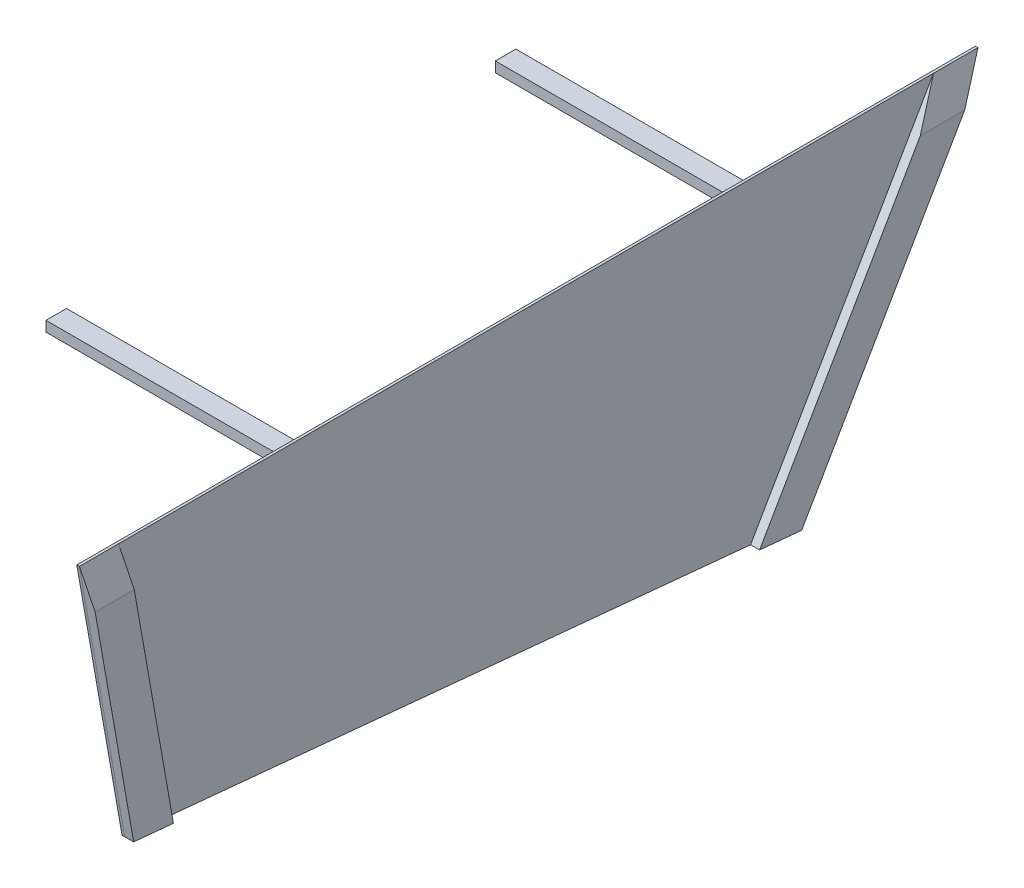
ISO-10303-21;
HEADER;
FILE_DESCRIPTION(('STEP AP214'),'2;1');
FILE_NAME('part.step','',(''),(''),'','','');
FILE_SCHEMA(('AUTOMOTIVE_DESIGN { 1 0 10303 214 1 1 1 1 }'));
ENDSEC;
DATA;
#1=APPLICATION_CONTEXT('core data for automotive mechanical design processes');
#2=APPLICATION_PROTOCOL_DEFINITION('international standard','automotive_design',2000,#1);
#3=PRODUCT_CONTEXT('',#1,'mechanical');
#4=PRODUCT('Part','Part','',(#3));
#5=PRODUCT_RELATED_PRODUCT_CATEGORY('part','',(#4));
#6=PRODUCT_DEFINITION_FORMATION('','',#4);
#7=PRODUCT_DEFINITION_CONTEXT('part definition',#1,'design');
#8=PRODUCT_DEFINITION('design','',#6,#7);
#9=PRODUCT_DEFINITION_SHAPE('','',#8);
#10=(LENGTH_UNIT() NAMED_UNIT(*) SI_UNIT(.MILLI.,.METRE.));
#11=(NAMED_UNIT(*) PLANE_ANGLE_UNIT() SI_UNIT($,.RADIAN.));
#12=(NAMED_UNIT(*) SI_UNIT($,.STERADIAN.) SOLID_ANGLE_UNIT());
#13=UNCERTAINTY_MEASURE_WITH_UNIT(LENGTH_MEASURE(1.E-05),#10,'distance_accuracy_value','');
#14=(GEOMETRIC_REPRESENTATION_CONTEXT(3) GLOBAL_UNCERTAINTY_ASSIGNED_CONTEXT((#13)) GLOBAL_UNIT_ASSIGNED_CONTEXT((#10,
#11,#12)) REPRESENTATION_CONTEXT('',''));
#15=CARTESIAN_POINT('',(0.,0.,0.));
#16=DIRECTION('',(0.,0.,1.));
#17=DIRECTION('',(1.,0.,0.));
#18=AXIS2_PLACEMENT_3D('',#15,#16,#17);
#19=CARTESIAN_POINT('',(40.,-974.233000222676,-2508.54773161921));
#20=DIRECTION('',(0.,-0.5,-0.866025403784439));
#21=DIRECTION('',(0.,0.866025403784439,-0.5));
#22=AXIS2_PLACEMENT_3D('',#19,#20,#21);
#23=PLANE('',#22);
#24=DIRECTION('',(0.,-0.866025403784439,0.5));
#25=VECTOR('',#24,1.);
#26=CARTESIAN_POINT('',(40.,-974.233000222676,-2508.54773161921));
#27=LINE('',#26,#25);
#28=CARTESIAN_POINT('',(40.,110.000000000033,-3134.52994616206));
#29=VERTEX_POINT('',#28);
#30=CARTESIAN_POINT('',(40.,-974.233000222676,-2508.54773161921));
#31=VERTEX_POINT('',#30);
#32=EDGE_CURVE('E101',#29,#31,#27,.T.);
#33=ORIENTED_EDGE('',*,*,#32,.F.);
#34=DIRECTION('',(0.198069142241,-0.84886775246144,0.490094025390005));
#35=VECTOR('',#34,1.);
#36=CARTESIAN_POINT('',(344.276668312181,-1194.04286419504,-2381.64044748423));
#37=LINE('',#36,#35);
#38=CARTESIAN_POINT('',(5.,260.000000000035,-3221.13248654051));
#39=VERTEX_POINT('',#38);
#40=EDGE_CURVE('E62',#29,#39,#37,.F.);
#41=ORIENTED_EDGE('',*,*,#40,.T.);
#42=DIRECTION('',(0.,-0.866025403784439,0.5));
#43=VECTOR('',#42,1.);
#44=CARTESIAN_POINT('',(5.,-974.233000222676,-2508.54773161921));
#45=LINE('',#44,#43);
#46=CARTESIAN_POINT('',(5.,-974.233000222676,-2508.54773161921));
#47=VERTEX_POINT('',#46);
#48=EDGE_CURVE('E106',#39,#47,#45,.T.);
#49=ORIENTED_EDGE('',*,*,#48,.T.);
#50=DIRECTION('',(-1.,0.,0.));
#51=VECTOR('',#50,1.);
#52=CARTESIAN_POINT('',(40.,-974.233000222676,-2508.54773161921));
#53=LINE('',#52,#51);
#54=EDGE_CURVE('E121',#31,#47,#53,.T.);
#55=ORIENTED_EDGE('',*,*,#54,.F.);
#56=EDGE_LOOP('',(#33,#41,#49,#55));
#57=FACE_BOUND('',#56,.T.);
#58=ADVANCED_FACE('F53',(#57),#23,.F.);
#59=CARTESIAN_POINT('',(40.,-989.999999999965,-2672.64973081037));
#60=DIRECTION('',(0.,0.995415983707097,-0.0956400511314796));
#61=DIRECTION('',(0.,0.0956400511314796,0.995415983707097));
#62=AXIS2_PLACEMENT_3D('',#59,#60,#61);
#63=PLANE('',#62);
#64=DIRECTION('',(0.,-0.0956400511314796,-0.995415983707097));
#65=VECTOR('',#64,1.);
#66=CARTESIAN_POINT('',(5.,-989.999999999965,-2672.64973081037));
#67=LINE('',#66,#65);
#68=CARTESIAN_POINT('',(5.,-989.999999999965,-2672.64973081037));
#69=VERTEX_POINT('',#68);
#70=EDGE_CURVE('E100',#47,#69,#67,.T.);
#71=ORIENTED_EDGE('',*,*,#70,.T.);
#72=DIRECTION('',(-1.,0.,0.));
#73=VECTOR('',#72,1.);
#74=CARTESIAN_POINT('',(40.,-989.999999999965,-2672.64973081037));
#75=LINE('',#74,#73);
#76=CARTESIAN_POINT('',(40.,-989.999999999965,-2672.64973081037));
#77=VERTEX_POINT('',#76);
#78=EDGE_CURVE('E97',#77,#69,#75,.T.);
#79=ORIENTED_EDGE('',*,*,#78,.F.);
#80=DIRECTION('',(0.,-0.0956400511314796,-0.995415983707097));
#81=VECTOR('',#80,1.);
#82=CARTESIAN_POINT('',(40.,-989.999999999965,-2672.64973081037));
#83=LINE('',#82,#81);
#84=EDGE_CURVE('E114',#31,#77,#83,.T.);
#85=ORIENTED_EDGE('',*,*,#84,.F.);
#86=ORIENTED_EDGE('',*,*,#54,.T.);
#87=EDGE_LOOP('',(#71,#79,#85,#86));
#88=FACE_BOUND('',#87,.T.);
#89=ADVANCED_FACE('F126',(#88),#63,.F.);
#90=CARTESIAN_POINT('',(40.,260.000000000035,-3394.33756729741));
#91=DIRECTION('',(0.,0.500000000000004,0.866025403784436));
#92=DIRECTION('',(0.,-0.866025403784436,0.500000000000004));
#93=AXIS2_PLACEMENT_3D('',#90,#91,#92);
#94=PLANE('',#93);
#95=DIRECTION('',(0.,0.866025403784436,-0.500000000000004));
#96=VECTOR('',#95,1.);
#97=CARTESIAN_POINT('',(5.,260.000000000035,-3394.33756729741));
#98=LINE('',#97,#96);
#99=CARTESIAN_POINT('',(5.,260.000000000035,-3394.33756729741));
#100=VERTEX_POINT('',#99);
#101=EDGE_CURVE('E93',#69,#100,#98,.T.);
#102=ORIENTED_EDGE('',*,*,#101,.T.);
#103=DIRECTION('',(-0.198069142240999,0.848867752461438,-0.490094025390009));
#104=VECTOR('',#103,1.);
#105=CARTESIAN_POINT('',(361.090119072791,-1266.10051031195,-2513.24302685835));
#106=LINE('',#105,#104);
#107=CARTESIAN_POINT('',(40.,110.000000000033,-3307.73502691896));
#108=VERTEX_POINT('',#107);
#109=EDGE_CURVE('E12',#100,#108,#106,.F.);
#110=ORIENTED_EDGE('',*,*,#109,.T.);
#111=DIRECTION('',(0.,0.866025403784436,-0.500000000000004));
#112=VECTOR('',#111,1.);
#113=CARTESIAN_POINT('',(40.,260.000000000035,-3394.33756729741));
#114=LINE('',#113,#112);
#115=EDGE_CURVE('E116',#77,#108,#114,.T.);
#116=ORIENTED_EDGE('',*,*,#115,.F.);
#117=ORIENTED_EDGE('',*,*,#78,.T.);
#118=EDGE_LOOP('',(#102,#110,#116,#117));
#119=FACE_BOUND('',#118,.T.);
#120=ADVANCED_FACE('F95',(#119),#94,.F.);
#121=CARTESIAN_POINT('',(40.,0.,0.));
#122=DIRECTION('',(-1.,0.,0.));
#123=DIRECTION('',(0.,0.,1.));
#124=AXIS2_PLACEMENT_3D('',#121,#122,#123);
#125=PLANE('',#124);
#126=ORIENTED_EDGE('',*,*,#115,.T.);
#127=DIRECTION('',(0.,0.,1.));
#128=VECTOR('',#127,1.);
#129=CARTESIAN_POINT('',(40.,110.000000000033,0.));
#130=LINE('',#129,#128);
#131=EDGE_CURVE('E107',#108,#29,#130,.T.);
#132=ORIENTED_EDGE('',*,*,#131,.T.);
#133=ORIENTED_EDGE('',*,*,#32,.T.);
#134=ORIENTED_EDGE('',*,*,#84,.T.);
#135=EDGE_LOOP('',(#126,#132,#133,#134));
#136=FACE_BOUND('',#135,.T.);
#137=ADVANCED_FACE('F128',(#136),#125,.F.);
#138=CARTESIAN_POINT('',(5.,0.,0.));
#139=DIRECTION('',(-1.,0.,0.));
#140=DIRECTION('',(0.,0.,1.));
#141=AXIS2_PLACEMENT_3D('',#138,#139,#140);
#142=PLANE('',#141);
#143=DIRECTION('',(0.,0.,1.));
#144=VECTOR('',#143,1.);
#145=CARTESIAN_POINT('',(5.,260.000000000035,-3221.13248654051));
#146=LINE('',#145,#144);
#147=EDGE_CURVE('E104',#100,#39,#146,.T.);
#148=ORIENTED_EDGE('',*,*,#147,.F.);
#149=ORIENTED_EDGE('',*,*,#101,.F.);
#150=ORIENTED_EDGE('',*,*,#70,.F.);
#151=ORIENTED_EDGE('',*,*,#48,.F.);
#152=EDGE_LOOP('',(#148,#149,#150,#151));
#153=FACE_BOUND('',#152,.T.);
#154=ADVANCED_FACE('F105',(#153),#142,.T.);
#155=CARTESIAN_POINT('',(40.,110.000000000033,0.));
#156=DIRECTION('',(-0.973841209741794,-0.227229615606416,0.));
#157=DIRECTION('',(0.,0.,1.));
#158=AXIS2_PLACEMENT_3D('',#155,#156,#157);
#159=PLANE('',#158);
#160=ORIENTED_EDGE('',*,*,#109,.F.);
#161=ORIENTED_EDGE('',*,*,#147,.T.);
#162=ORIENTED_EDGE('',*,*,#40,.F.);
#163=ORIENTED_EDGE('',*,*,#131,.F.);
#164=EDGE_LOOP('',(#160,#161,#162,#163));
#165=FACE_BOUND('',#164,.T.);
#166=ADVANCED_FACE('F56',(#165),#159,.F.);
#167=CLOSED_SHELL('',(#58,#89,#120,#137,#154,#166));
#168=MANIFOLD_SOLID_BREP('B2',#167);
#169=CARTESIAN_POINT('',(40.,260.000000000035,105.662432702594));
#170=DIRECTION('',(0.,0.173648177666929,-0.984807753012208));
#171=DIRECTION('',(0.,0.984807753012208,0.173648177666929));
#172=AXIS2_PLACEMENT_3D('',#169,#170,#171);
#173=PLANE('',#172);
#174=DIRECTION('',(0.,-0.984807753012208,-0.173648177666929));
#175=VECTOR('',#174,1.);
#176=CARTESIAN_POINT('',(40.,260.000000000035,105.662432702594));
#177=LINE('',#176,#175);
#178=CARTESIAN_POINT('',(40.,110.000000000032,79.2133855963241));
#179=VERTEX_POINT('',#178);
#180=CARTESIAN_POINT('',(40.,-739.999999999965,-70.6645480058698));
#181=VERTEX_POINT('',#180);
#182=EDGE_CURVE('E240',#179,#181,#177,.T.);
#183=ORIENTED_EDGE('',*,*,#182,.F.);
#184=DIRECTION('',(-0.223951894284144,0.959793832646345,0.169237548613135));
#185=VECTOR('',#184,1.);
#186=CARTESIAN_POINT('',(43.0022720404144,97.1331198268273,76.9446074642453));
#187=LINE('',#186,#185);
#188=CARTESIAN_POINT('',(5.,260.000000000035,105.662432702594));
#189=VERTEX_POINT('',#188);
#190=EDGE_CURVE('E209',#179,#189,#187,.T.);
#191=ORIENTED_EDGE('',*,*,#190,.T.);
#192=DIRECTION('',(0.,-0.984807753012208,-0.173648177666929));
#193=VECTOR('',#192,1.);
#194=CARTESIAN_POINT('',(5.,260.000000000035,105.662432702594));
#195=LINE('',#194,#193);
#196=CARTESIAN_POINT('',(5.,-739.999999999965,-70.6645480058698));
#197=VERTEX_POINT('',#196);
#198=EDGE_CURVE('E253',#189,#197,#195,.T.);
#199=ORIENTED_EDGE('',*,*,#198,.T.);
#200=DIRECTION('',(-1.,0.,0.));
#201=VECTOR('',#200,1.);
#202=CARTESIAN_POINT('',(40.,-739.999999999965,-70.6645480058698));
#203=LINE('',#202,#201);
#204=EDGE_CURVE('E251',#181,#197,#203,.T.);
#205=ORIENTED_EDGE('',*,*,#204,.F.);
#206=EDGE_LOOP('',(#183,#191,#199,#205));
#207=FACE_BOUND('',#206,.T.);
#208=ADVANCED_FACE('F200',(#207),#173,.F.);
#209=CARTESIAN_POINT('',(40.,-754.886604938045,-225.603449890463));
#210=DIRECTION('',(0.,0.995415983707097,-0.09564005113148));
#211=DIRECTION('',(0.,0.09564005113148,0.995415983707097));
#212=AXIS2_PLACEMENT_3D('',#209,#210,#211);
#213=PLANE('',#212);
#214=DIRECTION('',(0.,-0.09564005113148,-0.995415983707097));
#215=VECTOR('',#214,1.);
#216=CARTESIAN_POINT('',(5.,-754.886604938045,-225.603449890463));
#217=LINE('',#216,#215);
#218=CARTESIAN_POINT('',(5.,-754.886604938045,-225.603449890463));
#219=VERTEX_POINT('',#218);
#220=EDGE_CURVE('E267',#197,#219,#217,.T.);
#221=ORIENTED_EDGE('',*,*,#220,.T.);
#222=DIRECTION('',(-1.,0.,0.));
#223=VECTOR('',#222,1.);
#224=CARTESIAN_POINT('',(40.,-754.886604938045,-225.603449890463));
#225=LINE('',#224,#223);
#226=CARTESIAN_POINT('',(40.,-754.886604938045,-225.603449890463));
#227=VERTEX_POINT('',#226);
#228=EDGE_CURVE('E256',#227,#219,#225,.T.);
#229=ORIENTED_EDGE('',*,*,#228,.F.);
#230=DIRECTION('',(0.,-0.09564005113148,-0.995415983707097));
#231=VECTOR('',#230,1.);
#232=CARTESIAN_POINT('',(40.,-754.886604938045,-225.603449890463));
#233=LINE('',#232,#231);
#234=EDGE_CURVE('E244',#181,#227,#233,.T.);
#235=ORIENTED_EDGE('',*,*,#234,.F.);
#236=ORIENTED_EDGE('',*,*,#204,.T.);
#237=EDGE_LOOP('',(#221,#229,#235,#236));
#238=FACE_BOUND('',#237,.T.);
#239=ADVANCED_FACE('F258',(#238),#213,.F.);
#240=CARTESIAN_POINT('',(40.,260.000000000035,-46.6515590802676));
#241=DIRECTION('',(0.,-0.173648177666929,0.984807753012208));
#242=DIRECTION('',(0.,-0.984807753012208,-0.173648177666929));
#243=AXIS2_PLACEMENT_3D('',#240,#241,#242);
#244=PLANE('',#243);
#245=DIRECTION('',(0.,0.984807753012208,0.17364817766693));
#246=VECTOR('',#245,1.);
#247=CARTESIAN_POINT('',(5.,260.000000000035,-46.6515590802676));
#248=LINE('',#247,#246);
#249=CARTESIAN_POINT('',(5.,260.000000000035,-46.6515590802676));
#250=VERTEX_POINT('',#249);
#251=EDGE_CURVE('E248',#219,#250,#248,.T.);
#252=ORIENTED_EDGE('',*,*,#251,.T.);
#253=DIRECTION('',(0.223951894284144,-0.959793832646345,-0.169237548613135));
#254=VECTOR('',#253,1.);
#255=CARTESIAN_POINT('',(37.2294088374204,121.873962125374,-71.0069062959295));
#256=LINE('',#255,#254);
#257=CARTESIAN_POINT('',(40.,110.000000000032,-73.1006061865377));
#258=VERTEX_POINT('',#257);
#259=EDGE_CURVE('E51',#250,#258,#256,.T.);
#260=ORIENTED_EDGE('',*,*,#259,.T.);
#261=DIRECTION('',(0.,0.984807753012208,0.17364817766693));
#262=VECTOR('',#261,1.);
#263=CARTESIAN_POINT('',(40.,260.000000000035,-46.6515590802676));
#264=LINE('',#263,#262);
#265=EDGE_CURVE('E260',#227,#258,#264,.T.);
#266=ORIENTED_EDGE('',*,*,#265,.F.);
#267=ORIENTED_EDGE('',*,*,#228,.T.);
#268=EDGE_LOOP('',(#252,#260,#266,#267));
#269=FACE_BOUND('',#268,.T.);
#270=ADVANCED_FACE('F284',(#269),#244,.F.);
#271=CARTESIAN_POINT('',(40.,0.,0.));
#272=DIRECTION('',(1.,0.,0.));
#273=DIRECTION('',(0.,0.,-1.));
#274=AXIS2_PLACEMENT_3D('',#271,#272,#273);
#275=PLANE('',#274);
#276=ORIENTED_EDGE('',*,*,#265,.T.);
#277=DIRECTION('',(0.,0.,1.));
#278=VECTOR('',#277,1.);
#279=CARTESIAN_POINT('',(40.,110.000000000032,105.662432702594));
#280=LINE('',#279,#278);
#281=EDGE_CURVE('E246',#258,#179,#280,.T.);
#282=ORIENTED_EDGE('',*,*,#281,.T.);
#283=ORIENTED_EDGE('',*,*,#182,.T.);
#284=ORIENTED_EDGE('',*,*,#234,.T.);
#285=EDGE_LOOP('',(#276,#282,#283,#284));
#286=FACE_BOUND('',#285,.T.);
#287=ADVANCED_FACE('F242',(#286),#275,.T.);
#288=CARTESIAN_POINT('',(5.,0.,0.));
#289=DIRECTION('',(1.,0.,0.));
#290=DIRECTION('',(0.,0.,-1.));
#291=AXIS2_PLACEMENT_3D('',#288,#289,#290);
#292=PLANE('',#291);
#293=DIRECTION('',(0.,0.,1.));
#294=VECTOR('',#293,1.);
#295=CARTESIAN_POINT('',(5.,260.000000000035,-46.6515590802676));
#296=LINE('',#295,#294);
#297=EDGE_CURVE('E264',#250,#189,#296,.T.);
#298=ORIENTED_EDGE('',*,*,#297,.F.);
#299=ORIENTED_EDGE('',*,*,#251,.F.);
#300=ORIENTED_EDGE('',*,*,#220,.F.);
#301=ORIENTED_EDGE('',*,*,#198,.F.);
#302=EDGE_LOOP('',(#298,#299,#300,#301));
#303=FACE_BOUND('',#302,.T.);
#304=ADVANCED_FACE('F273',(#303),#292,.F.);
#305=CARTESIAN_POINT('',(40.,110.000000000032,0.));
#306=DIRECTION('',(0.973841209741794,0.227229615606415,0.));
#307=DIRECTION('',(0.,0.,-1.));
#308=AXIS2_PLACEMENT_3D('',#305,#306,#307);
#309=PLANE('',#308);
#310=ORIENTED_EDGE('',*,*,#259,.F.);
#311=ORIENTED_EDGE('',*,*,#297,.T.);
#312=ORIENTED_EDGE('',*,*,#190,.F.);
#313=ORIENTED_EDGE('',*,*,#281,.F.);
#314=EDGE_LOOP('',(#310,#311,#312,#313));
#315=FACE_BOUND('',#314,.T.);
#316=ADVANCED_FACE('F203',(#315),#309,.T.);
#317=CLOSED_SHELL('',(#208,#239,#270,#287,#304,#316));
#318=MANIFOLD_SOLID_BREP('B6',#317);
#319=CARTESIAN_POINT('',(5.,260.000000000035,-3394.33756729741));
#320=DIRECTION('',(0.,0.500000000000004,0.866025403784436));
#321=DIRECTION('',(0.,-0.866025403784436,0.500000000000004));
#322=AXIS2_PLACEMENT_3D('',#319,#320,#321);
#323=PLANE('',#322);
#324=DIRECTION('',(0.,0.866025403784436,-0.500000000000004));
#325=VECTOR('',#324,1.);
#326=CARTESIAN_POINT('',(-5.,260.000000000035,-3394.33756729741));
#327=LINE('',#326,#325);
#328=CARTESIAN_POINT('',(-5.,-989.999999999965,-2672.64973081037));
#329=VERTEX_POINT('',#328);
#330=CARTESIAN_POINT('',(-5.,260.000000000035,-3394.33756729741));
#331=VERTEX_POINT('',#330);
#332=EDGE_CURVE('E468',#329,#331,#327,.T.);
#333=ORIENTED_EDGE('',*,*,#332,.T.);
#334=DIRECTION('',(-1.,0.,0.));
#335=VECTOR('',#334,1.);
#336=CARTESIAN_POINT('',(5.,260.000000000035,-3394.33756729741));
#337=LINE('',#336,#335);
#338=CARTESIAN_POINT('',(5.,260.000000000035,-3394.33756729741));
#339=VERTEX_POINT('',#338);
#340=EDGE_CURVE('E502',#339,#331,#337,.T.);
#341=ORIENTED_EDGE('',*,*,#340,.F.);
#342=DIRECTION('',(0.,0.866025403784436,-0.500000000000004));
#343=VECTOR('',#342,1.);
#344=CARTESIAN_POINT('',(5.,-989.999999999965,-2672.64973081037));
#345=LINE('',#344,#343);
#346=CARTESIAN_POINT('',(5.,-989.999999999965,-2672.64973081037));
#347=VERTEX_POINT('',#346);
#348=EDGE_CURVE('E477',#347,#339,#345,.T.);
#349=ORIENTED_EDGE('',*,*,#348,.F.);
#350=DIRECTION('',(-1.,0.,0.));
#351=VECTOR('',#350,1.);
#352=CARTESIAN_POINT('',(5.,-989.999999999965,-2672.64973081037));
#353=LINE('',#352,#351);
#354=EDGE_CURVE('E486',#347,#329,#353,.T.);
#355=ORIENTED_EDGE('',*,*,#354,.T.);
#356=EDGE_LOOP('',(#333,#341,#349,#355));
#357=FACE_BOUND('',#356,.T.);
#358=ADVANCED_FACE('F338',(#357),#323,.F.);
#359=CARTESIAN_POINT('',(5.,260.000000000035,105.662432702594));
#360=DIRECTION('',(0.,-1.,0.));
#361=DIRECTION('',(0.,0.,-1.));
#362=AXIS2_PLACEMENT_3D('',#359,#360,#361);
#363=PLANE('',#362);
#364=DIRECTION('',(0.,0.,1.));
#365=VECTOR('',#364,1.);
#366=CARTESIAN_POINT('',(-5.,260.000000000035,105.662432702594));
#367=LINE('',#366,#365);
#368=CARTESIAN_POINT('',(-5.,260.000000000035,105.662432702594));
#369=VERTEX_POINT('',#368);
#370=EDGE_CURVE('E488',#331,#369,#367,.T.);
#371=ORIENTED_EDGE('',*,*,#370,.T.);
#372=DIRECTION('',(-1.,0.,0.));
#373=VECTOR('',#372,1.);
#374=CARTESIAN_POINT('',(5.,260.000000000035,105.662432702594));
#375=LINE('',#374,#373);
#376=CARTESIAN_POINT('',(5.,260.000000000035,105.662432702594));
#377=VERTEX_POINT('',#376);
#378=EDGE_CURVE('E499',#377,#369,#375,.T.);
#379=ORIENTED_EDGE('',*,*,#378,.F.);
#380=DIRECTION('',(0.,0.,1.));
#381=VECTOR('',#380,1.);
#382=CARTESIAN_POINT('',(5.,260.000000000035,105.662432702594));
#383=LINE('',#382,#381);
#384=EDGE_CURVE('E479',#339,#377,#383,.T.);
#385=ORIENTED_EDGE('',*,*,#384,.F.);
#386=ORIENTED_EDGE('',*,*,#340,.T.);
#387=EDGE_LOOP('',(#371,#379,#385,#386));
#388=FACE_BOUND('',#387,.T.);
#389=ADVANCED_FACE('F551',(#388),#363,.F.);
#390=CARTESIAN_POINT('',(5.,260.000000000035,105.662432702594));
#391=DIRECTION('',(0.,0.173648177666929,-0.984807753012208));
#392=DIRECTION('',(0.,0.984807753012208,0.173648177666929));
#393=AXIS2_PLACEMENT_3D('',#390,#391,#392);
#394=PLANE('',#393);
#395=DIRECTION('',(0.,-0.984807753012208,-0.173648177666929));
#396=VECTOR('',#395,1.);
#397=CARTESIAN_POINT('',(-5.,260.000000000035,105.662432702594));
#398=LINE('',#397,#396);
#399=CARTESIAN_POINT('',(-5.,-739.999999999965,-70.6645480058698));
#400=VERTEX_POINT('',#399);
#401=EDGE_CURVE('E490',#369,#400,#398,.T.);
#402=ORIENTED_EDGE('',*,*,#401,.T.);
#403=DIRECTION('',(-1.,0.,0.));
#404=VECTOR('',#403,1.);
#405=CARTESIAN_POINT('',(5.,-739.999999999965,-70.6645480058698));
#406=LINE('',#405,#404);
#407=CARTESIAN_POINT('',(5.,-739.999999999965,-70.6645480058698));
#408=VERTEX_POINT('',#407);
#409=EDGE_CURVE('E496',#408,#400,#406,.T.);
#410=ORIENTED_EDGE('',*,*,#409,.F.);
#411=DIRECTION('',(0.,-0.984807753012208,-0.173648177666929));
#412=VECTOR('',#411,1.);
#413=CARTESIAN_POINT('',(5.,260.000000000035,105.662432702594));
#414=LINE('',#413,#412);
#415=EDGE_CURVE('E482',#377,#408,#414,.T.);
#416=ORIENTED_EDGE('',*,*,#415,.F.);
#417=ORIENTED_EDGE('',*,*,#378,.T.);
#418=EDGE_LOOP('',(#402,#410,#416,#417));
#419=FACE_BOUND('',#418,.T.);
#420=ADVANCED_FACE('F549',(#419),#394,.F.);
#421=CARTESIAN_POINT('',(5.,-739.999999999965,-70.6645480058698));
#422=DIRECTION('',(0.,0.995415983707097,-0.0956400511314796));
#423=DIRECTION('',(0.,0.0956400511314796,0.995415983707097));
#424=AXIS2_PLACEMENT_3D('',#421,#422,#423);
#425=PLANE('',#424);
#426=DIRECTION('',(0.,-0.0956400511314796,-0.995415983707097));
#427=VECTOR('',#426,1.);
#428=CARTESIAN_POINT('',(-5.,-739.999999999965,-70.6645480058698));
#429=LINE('',#428,#427);
#430=EDGE_CURVE('E480',#400,#329,#429,.T.);
#431=ORIENTED_EDGE('',*,*,#430,.T.);
#432=ORIENTED_EDGE('',*,*,#354,.F.);
#433=DIRECTION('',(0.,-0.0956400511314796,-0.995415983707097));
#434=VECTOR('',#433,1.);
#435=CARTESIAN_POINT('',(5.,-739.999999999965,-70.6645480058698));
#436=LINE('',#435,#434);
#437=EDGE_CURVE('E484',#408,#347,#436,.T.);
#438=ORIENTED_EDGE('',*,*,#437,.F.);
#439=ORIENTED_EDGE('',*,*,#409,.T.);
#440=EDGE_LOOP('',(#431,#432,#438,#439));
#441=FACE_BOUND('',#440,.T.);
#442=ADVANCED_FACE('F540',(#441),#425,.F.);
#443=CARTESIAN_POINT('',(5.,0.,0.));
#444=DIRECTION('',(-1.,0.,0.));
#445=DIRECTION('',(0.,0.,1.));
#446=AXIS2_PLACEMENT_3D('',#443,#444,#445);
#447=PLANE('',#446);
#448=ORIENTED_EDGE('',*,*,#348,.T.);
#449=ORIENTED_EDGE('',*,*,#384,.T.);
#450=ORIENTED_EDGE('',*,*,#415,.T.);
#451=ORIENTED_EDGE('',*,*,#437,.T.);
#452=EDGE_LOOP('',(#448,#449,#450,#451));
#453=FACE_BOUND('',#452,.T.);
#454=ADVANCED_FACE('F530',(#453),#447,.F.);
#455=CARTESIAN_POINT('',(-5.,0.,0.));
#456=DIRECTION('',(-1.,0.,0.));
#457=DIRECTION('',(0.,0.,1.));
#458=AXIS2_PLACEMENT_3D('',#455,#456,#457);
#459=PLANE('',#458);
#460=DIRECTION('',(0.,-1.,0.));
#461=VECTOR('',#460,1.);
#462=CARTESIAN_POINT('',(-5.,0.,-749.337567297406));
#463=LINE('',#462,#461);
#464=CARTESIAN_POINT('',(-5.,250.000000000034,-749.337567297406));
#465=VERTEX_POINT('',#464);
#466=CARTESIAN_POINT('',(-5.,210.000000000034,-749.337567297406));
#467=VERTEX_POINT('',#466);
#468=EDGE_CURVE('E198',#465,#467,#463,.T.);
#469=ORIENTED_EDGE('',*,*,#468,.F.);
#470=DIRECTION('',(0.,0.,-1.));
#471=VECTOR('',#470,1.);
#472=CARTESIAN_POINT('',(-5.,250.000000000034,0.));
#473=LINE('',#472,#471);
#474=CARTESIAN_POINT('',(-5.,250.000000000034,-669.337567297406));
#475=VERTEX_POINT('',#474);
#476=EDGE_CURVE('E517',#475,#465,#473,.T.);
#477=ORIENTED_EDGE('',*,*,#476,.F.);
#478=DIRECTION('',(0.,1.,0.));
#479=VECTOR('',#478,1.);
#480=CARTESIAN_POINT('',(-5.,0.,-669.337567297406));
#481=LINE('',#480,#479);
#482=CARTESIAN_POINT('',(-5.,210.000000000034,-669.337567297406));
#483=VERTEX_POINT('',#482);
#484=EDGE_CURVE('E355',#483,#475,#481,.T.);
#485=ORIENTED_EDGE('',*,*,#484,.F.);
#486=DIRECTION('',(0.,0.,1.));
#487=VECTOR('',#486,1.);
#488=CARTESIAN_POINT('',(-5.,210.000000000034,0.));
#489=LINE('',#488,#487);
#490=EDGE_CURVE('E345',#467,#483,#489,.T.);
#491=ORIENTED_EDGE('',*,*,#490,.F.);
#492=EDGE_LOOP('',(#469,#477,#485,#491));
#493=FACE_BOUND('',#492,.T.);
#494=DIRECTION('',(0.,-1.,0.));
#495=VECTOR('',#494,1.);
#496=CARTESIAN_POINT('',(-5.,0.,-2499.33756729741));
#497=LINE('',#496,#495);
#498=CARTESIAN_POINT('',(-5.,250.000000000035,-2499.33756729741));
#499=VERTEX_POINT('',#498);
#500=CARTESIAN_POINT('',(-5.,210.000000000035,-2499.33756729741));
#501=VERTEX_POINT('',#500);
#502=EDGE_CURVE('E514',#499,#501,#497,.T.);
#503=ORIENTED_EDGE('',*,*,#502,.F.);
#504=DIRECTION('',(0.,0.,-1.));
#505=VECTOR('',#504,1.);
#506=CARTESIAN_POINT('',(-5.,250.000000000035,0.));
#507=LINE('',#506,#505);
#508=CARTESIAN_POINT('',(-5.,250.000000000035,-2419.33756729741));
#509=VERTEX_POINT('',#508);
#510=EDGE_CURVE('E505',#509,#499,#507,.T.);
#511=ORIENTED_EDGE('',*,*,#510,.F.);
#512=DIRECTION('',(0.,1.,0.));
#513=VECTOR('',#512,1.);
#514=CARTESIAN_POINT('',(-5.,0.,-2419.33756729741));
#515=LINE('',#514,#513);
#516=CARTESIAN_POINT('',(-5.,210.000000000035,-2419.33756729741));
#517=VERTEX_POINT('',#516);
#518=EDGE_CURVE('E508',#517,#509,#515,.T.);
#519=ORIENTED_EDGE('',*,*,#518,.F.);
#520=DIRECTION('',(0.,0.,1.));
#521=VECTOR('',#520,1.);
#522=CARTESIAN_POINT('',(-5.,210.000000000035,0.));
#523=LINE('',#522,#521);
#524=EDGE_CURVE('E511',#501,#517,#523,.T.);
#525=ORIENTED_EDGE('',*,*,#524,.F.);
#526=EDGE_LOOP('',(#503,#511,#519,#525));
#527=FACE_BOUND('',#526,.T.);
#528=ORIENTED_EDGE('',*,*,#332,.F.);
#529=ORIENTED_EDGE('',*,*,#430,.F.);
#530=ORIENTED_EDGE('',*,*,#401,.F.);
#531=ORIENTED_EDGE('',*,*,#370,.F.);
#532=EDGE_LOOP('',(#528,#529,#530,#531));
#533=FACE_BOUND('',#532,.T.);
#534=ADVANCED_FACE('F526',(#493,#527,#533),#459,.T.);
#535=CARTESIAN_POINT('',(-900.,210.000000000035,-2499.33756729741));
#536=DIRECTION('',(0.,0.,-1.));
#537=DIRECTION('',(-1.,0.,0.));
#538=AXIS2_PLACEMENT_3D('',#535,#536,#537);
#539=PLANE('',#538);
#540=DIRECTION('',(1.,0.,0.));
#541=VECTOR('',#540,1.);
#542=CARTESIAN_POINT('',(-900.,250.000000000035,-2499.33756729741));
#543=LINE('',#542,#541);
#544=CARTESIAN_POINT('',(-900.,250.000000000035,-2499.33756729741));
#545=VERTEX_POINT('',#544);
#546=EDGE_CURVE('E464',#545,#499,#543,.T.);
#547=ORIENTED_EDGE('',*,*,#546,.T.);
#548=ORIENTED_EDGE('',*,*,#502,.T.);
#549=DIRECTION('',(1.,0.,0.));
#550=VECTOR('',#549,1.);
#551=CARTESIAN_POINT('',(-900.,210.000000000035,-2499.33756729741));
#552=LINE('',#551,#550);
#553=CARTESIAN_POINT('',(-900.,210.000000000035,-2499.33756729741));
#554=VERTEX_POINT('',#553);
#555=EDGE_CURVE('E465',#554,#501,#552,.T.);
#556=ORIENTED_EDGE('',*,*,#555,.F.);
#557=DIRECTION('',(0.,1.,0.));
#558=VECTOR('',#557,1.);
#559=CARTESIAN_POINT('',(-900.,210.000000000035,-2499.33756729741));
#560=LINE('',#559,#558);
#561=EDGE_CURVE('E439',#554,#545,#560,.T.);
#562=ORIENTED_EDGE('',*,*,#561,.T.);
#563=EDGE_LOOP('',(#547,#548,#556,#562));
#564=FACE_BOUND('',#563,.T.);
#565=ADVANCED_FACE('F529',(#564),#539,.T.);
#566=CARTESIAN_POINT('',(-900.,210.000000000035,-2419.33756729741));
#567=DIRECTION('',(0.,-1.,0.));
#568=DIRECTION('',(0.,0.,-1.));
#569=AXIS2_PLACEMENT_3D('',#566,#567,#568);
#570=PLANE('',#569);
#571=ORIENTED_EDGE('',*,*,#555,.T.);
#572=ORIENTED_EDGE('',*,*,#524,.T.);
#573=DIRECTION('',(1.,0.,0.));
#574=VECTOR('',#573,1.);
#575=CARTESIAN_POINT('',(-900.,210.000000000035,-2419.33756729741));
#576=LINE('',#575,#574);
#577=CARTESIAN_POINT('',(-900.,210.000000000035,-2419.33756729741));
#578=VERTEX_POINT('',#577);
#579=EDGE_CURVE('E469',#578,#517,#576,.T.);
#580=ORIENTED_EDGE('',*,*,#579,.F.);
#581=DIRECTION('',(0.,0.,-1.));
#582=VECTOR('',#581,1.);
#583=CARTESIAN_POINT('',(-900.,210.000000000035,-2419.33756729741));
#584=LINE('',#583,#582);
#585=EDGE_CURVE('E461',#578,#554,#584,.T.);
#586=ORIENTED_EDGE('',*,*,#585,.T.);
#587=EDGE_LOOP('',(#571,#572,#580,#586));
#588=FACE_BOUND('',#587,.T.);
#589=ADVANCED_FACE('F565',(#588),#570,.T.);
#590=CARTESIAN_POINT('',(-900.,210.000000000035,-2419.33756729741));
#591=DIRECTION('',(0.,0.,1.));
#592=DIRECTION('',(1.,0.,0.));
#593=AXIS2_PLACEMENT_3D('',#590,#591,#592);
#594=PLANE('',#593);
#595=ORIENTED_EDGE('',*,*,#579,.T.);
#596=ORIENTED_EDGE('',*,*,#518,.T.);
#597=DIRECTION('',(1.,0.,0.));
#598=VECTOR('',#597,1.);
#599=CARTESIAN_POINT('',(-900.,250.000000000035,-2419.33756729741));
#600=LINE('',#599,#598);
#601=CARTESIAN_POINT('',(-900.,250.000000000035,-2419.33756729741));
#602=VERTEX_POINT('',#601);
#603=EDGE_CURVE('E472',#602,#509,#600,.T.);
#604=ORIENTED_EDGE('',*,*,#603,.F.);
#605=DIRECTION('',(0.,-1.,0.));
#606=VECTOR('',#605,1.);
#607=CARTESIAN_POINT('',(-900.,210.000000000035,-2419.33756729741));
#608=LINE('',#607,#606);
#609=EDGE_CURVE('E458',#602,#578,#608,.T.);
#610=ORIENTED_EDGE('',*,*,#609,.T.);
#611=EDGE_LOOP('',(#595,#596,#604,#610));
#612=FACE_BOUND('',#611,.T.);
#613=ADVANCED_FACE('F571',(#612),#594,.T.);
#614=CARTESIAN_POINT('',(-900.,250.000000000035,-2419.33756729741));
#615=DIRECTION('',(0.,1.,0.));
#616=DIRECTION('',(0.,0.,1.));
#617=AXIS2_PLACEMENT_3D('',#614,#615,#616);
#618=PLANE('',#617);
#619=ORIENTED_EDGE('',*,*,#603,.T.);
#620=ORIENTED_EDGE('',*,*,#510,.T.);
#621=ORIENTED_EDGE('',*,*,#546,.F.);
#622=DIRECTION('',(0.,0.,1.));
#623=VECTOR('',#622,1.);
#624=CARTESIAN_POINT('',(-900.,250.000000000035,-2419.33756729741));
#625=LINE('',#624,#623);
#626=EDGE_CURVE('E455',#545,#602,#625,.T.);
#627=ORIENTED_EDGE('',*,*,#626,.T.);
#628=EDGE_LOOP('',(#619,#620,#621,#627));
#629=FACE_BOUND('',#628,.T.);
#630=ADVANCED_FACE('F567',(#629),#618,.T.);
#631=CARTESIAN_POINT('',(-900.,0.,0.));
#632=DIRECTION('',(-1.,0.,0.));
#633=DIRECTION('',(0.,0.,1.));
#634=AXIS2_PLACEMENT_3D('',#631,#632,#633);
#635=PLANE('',#634);
#636=ORIENTED_EDGE('',*,*,#561,.F.);
#637=ORIENTED_EDGE('',*,*,#585,.F.);
#638=ORIENTED_EDGE('',*,*,#609,.F.);
#639=ORIENTED_EDGE('',*,*,#626,.F.);
#640=EDGE_LOOP('',(#636,#637,#638,#639));
#641=FACE_BOUND('',#640,.T.);
#642=ADVANCED_FACE('F570',(#641),#635,.T.);
#643=CARTESIAN_POINT('',(-900.,210.000000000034,-749.337567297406));
#644=DIRECTION('',(0.,0.,-1.));
#645=DIRECTION('',(-1.,0.,0.));
#646=AXIS2_PLACEMENT_3D('',#643,#644,#645);
#647=PLANE('',#646);
#648=DIRECTION('',(1.,0.,0.));
#649=VECTOR('',#648,1.);
#650=CARTESIAN_POINT('',(-900.,250.000000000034,-749.337567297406));
#651=LINE('',#650,#649);
#652=CARTESIAN_POINT('',(-900.,250.000000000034,-749.337567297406));
#653=VERTEX_POINT('',#652);
#654=EDGE_CURVE('E445',#653,#465,#651,.T.);
#655=ORIENTED_EDGE('',*,*,#654,.T.);
#656=ORIENTED_EDGE('',*,*,#468,.T.);
#657=DIRECTION('',(1.,0.,0.));
#658=VECTOR('',#657,1.);
#659=CARTESIAN_POINT('',(-900.,210.000000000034,-749.337567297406));
#660=LINE('',#659,#658);
#661=CARTESIAN_POINT('',(-900.,210.000000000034,-749.337567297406));
#662=VERTEX_POINT('',#661);
#663=EDGE_CURVE('E422',#662,#467,#660,.T.);
#664=ORIENTED_EDGE('',*,*,#663,.F.);
#665=DIRECTION('',(0.,1.,0.));
#666=VECTOR('',#665,1.);
#667=CARTESIAN_POINT('',(-900.,210.000000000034,-749.337567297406));
#668=LINE('',#667,#666);
#669=EDGE_CURVE('E426',#662,#653,#668,.T.);
#670=ORIENTED_EDGE('',*,*,#669,.T.);
#671=EDGE_LOOP('',(#655,#656,#664,#670));
#672=FACE_BOUND('',#671,.T.);
#673=ADVANCED_FACE('F425',(#672),#647,.T.);
#674=CARTESIAN_POINT('',(-900.,210.000000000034,-669.337567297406));
#675=DIRECTION('',(0.,-1.,0.));
#676=DIRECTION('',(0.,0.,-1.));
#677=AXIS2_PLACEMENT_3D('',#674,#675,#676);
#678=PLANE('',#677);
#679=ORIENTED_EDGE('',*,*,#663,.T.);
#680=ORIENTED_EDGE('',*,*,#490,.T.);
#681=DIRECTION('',(1.,0.,0.));
#682=VECTOR('',#681,1.);
#683=CARTESIAN_POINT('',(-900.,210.000000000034,-669.337567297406));
#684=LINE('',#683,#682);
#685=CARTESIAN_POINT('',(-900.,210.000000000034,-669.337567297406));
#686=VERTEX_POINT('',#685);
#687=EDGE_CURVE('E429',#686,#483,#684,.T.);
#688=ORIENTED_EDGE('',*,*,#687,.F.);
#689=DIRECTION('',(0.,0.,-1.));
#690=VECTOR('',#689,1.);
#691=CARTESIAN_POINT('',(-900.,210.000000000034,-669.337567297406));
#692=LINE('',#691,#690);
#693=EDGE_CURVE('E436',#686,#662,#692,.T.);
#694=ORIENTED_EDGE('',*,*,#693,.T.);
#695=EDGE_LOOP('',(#679,#680,#688,#694));
#696=FACE_BOUND('',#695,.T.);
#697=ADVANCED_FACE('F441',(#696),#678,.T.);
#698=CARTESIAN_POINT('',(-900.,210.000000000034,-669.337567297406));
#699=DIRECTION('',(0.,0.,1.));
#700=DIRECTION('',(1.,0.,0.));
#701=AXIS2_PLACEMENT_3D('',#698,#699,#700);
#702=PLANE('',#701);
#703=ORIENTED_EDGE('',*,*,#687,.T.);
#704=ORIENTED_EDGE('',*,*,#484,.T.);
#705=DIRECTION('',(1.,0.,0.));
#706=VECTOR('',#705,1.);
#707=CARTESIAN_POINT('',(-900.,250.000000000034,-669.337567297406));
#708=LINE('',#707,#706);
#709=CARTESIAN_POINT('',(-900.,250.000000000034,-669.337567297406));
#710=VERTEX_POINT('',#709);
#711=EDGE_CURVE('E448',#710,#475,#708,.T.);
#712=ORIENTED_EDGE('',*,*,#711,.F.);
#713=DIRECTION('',(0.,-1.,0.));
#714=VECTOR('',#713,1.);
#715=CARTESIAN_POINT('',(-900.,210.000000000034,-669.337567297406));
#716=LINE('',#715,#714);
#717=EDGE_CURVE('E444',#710,#686,#716,.T.);
#718=ORIENTED_EDGE('',*,*,#717,.T.);
#719=EDGE_LOOP('',(#703,#704,#712,#718));
#720=FACE_BOUND('',#719,.T.);
#721=ADVANCED_FACE('F521',(#720),#702,.T.);
#722=CARTESIAN_POINT('',(-900.,250.000000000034,-669.337567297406));
#723=DIRECTION('',(0.,1.,0.));
#724=DIRECTION('',(0.,0.,1.));
#725=AXIS2_PLACEMENT_3D('',#722,#723,#724);
#726=PLANE('',#725);
#727=ORIENTED_EDGE('',*,*,#711,.T.);
#728=ORIENTED_EDGE('',*,*,#476,.T.);
#729=ORIENTED_EDGE('',*,*,#654,.F.);
#730=DIRECTION('',(0.,0.,1.));
#731=VECTOR('',#730,1.);
#732=CARTESIAN_POINT('',(-900.,250.000000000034,-669.337567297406));
#733=LINE('',#732,#731);
#734=EDGE_CURVE('E438',#653,#710,#733,.T.);
#735=ORIENTED_EDGE('',*,*,#734,.T.);
#736=EDGE_LOOP('',(#727,#728,#729,#735));
#737=FACE_BOUND('',#736,.T.);
#738=ADVANCED_FACE('F525',(#737),#726,.T.);
#739=CARTESIAN_POINT('',(-900.,0.,0.));
#740=DIRECTION('',(-1.,0.,0.));
#741=DIRECTION('',(0.,0.,1.));
#742=AXIS2_PLACEMENT_3D('',#739,#740,#741);
#743=PLANE('',#742);
#744=ORIENTED_EDGE('',*,*,#669,.F.);
#745=ORIENTED_EDGE('',*,*,#693,.F.);
#746=ORIENTED_EDGE('',*,*,#717,.F.);
#747=ORIENTED_EDGE('',*,*,#734,.F.);
#748=EDGE_LOOP('',(#744,#745,#746,#747));
#749=FACE_BOUND('',#748,.T.);
#750=ADVANCED_FACE('F434',(#749),#743,.T.);
#751=CLOSED_SHELL('',(#358,#389,#420,#442,#454,#534,#565,#589,#613,#630,#642,#673,#697,#721,
#738,#750));
#752=MANIFOLD_SOLID_BREP('B45',#751);
#753=ADVANCED_BREP_SHAPE_REPRESENTATION('',(#18,#168,#318,#752),#14);
#754=SHAPE_DEFINITION_REPRESENTATION(#9,#753);
ENDSEC;
END-ISO-10303-21;
